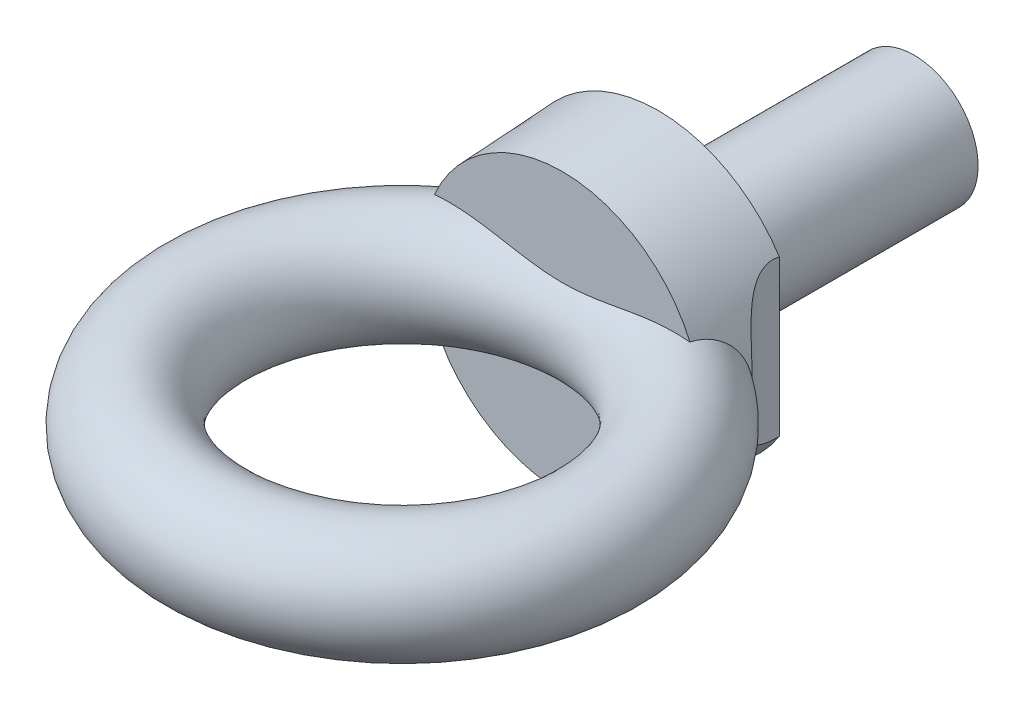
from build123d import *
from build123d.topology import SkipClean

# Parameters (mm, degrees)
SKETCH2_R           = 7
CUT_EXTRUDE_1_DEPTH = 150


with BuildPart() as part:
    # Sketch1 → Revolve1 (revolve)
    with BuildSketch(Plane(origin=(0, 0, 0), x_dir=(1, 0, 0), z_dir=(0, 1, 0)), mode=Mode.PRIVATE) as revolve1_sk:
        Polygon((0, 0), (0, 32), (8, 32), (8, 0), (18, 0), (17.4, -12), (0, -12), align=None)
    revolve(revolve1_sk.sketch.rotate(Axis((0, 0, 0), (0, 0, 1)), 180), axis=Axis((0, 0, 0), (0, 0, 1)))

    # Sketch2 → Revolve2 (revolve)
    with SkipClean():  # the faces are left unmerged after this step: merging them gives an invalid solid
        with BuildSketch(Plane.XY.offset(32), mode=Mode.PRIVATE) as revolve2_sk:
            with Locations((-24.5, 0)):
                Circle(SKETCH2_R)
        revolve(revolve2_sk.sketch.rotate(Axis((0, 0, 32), (0, -1, 0)), 340.698737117), axis=Axis((0, 0, 32), (0, -1, 0)))

    # Sketch 1 → Cut-Extrude 1 (cut, symmetric)
    with SkipClean():  # the faces are left unmerged after this step: merging them gives an invalid solid
        with BuildSketch(Plane(origin=(0, 0, 0), x_dir=(1, 0, 0), z_dir=(0, 1, 0))):
            with BuildLine():
                Line((-17.702749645, -5.9450071), (-18, 0))
                Line((-18, 0), (-15.155632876, 0))
                ThreePointArc((-15.155632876, 0), (-15.559582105, -3.345084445), (-17.702749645, -5.9450071))
            make_face()
            with BuildLine():
                Line((17.702749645, -5.9450071), (18, 0))
                Line((18, 0), (15.155632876, 0))
                ThreePointArc((15.155632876, 0), (15.559582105, -3.345084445), (17.702749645, -5.9450071))
            make_face()
        extrude(amount=CUT_EXTRUDE_1_DEPTH, both=True, mode=Mode.SUBTRACT)


solid = part.part
